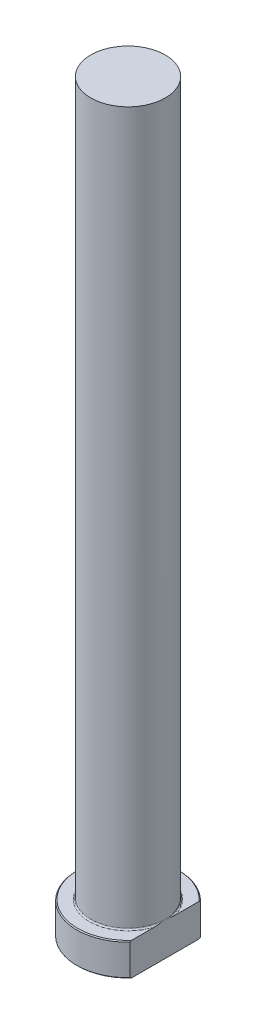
from build123d import *
from build123d.topology import SkipClean

# Parameters (mm, degrees)
CHAMFER1_SIZE = 0.2
FILLET1_R     = 0.3
KEY_DEPTH     = 161.754471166


with BuildPart() as part:
    # Sketch1 → Revolve1 (revolve)
    with BuildSketch(Plane.XY, mode=Mode.PRIVATE) as revolve1_sk:
        Polygon((0, 0), (-11, 0), (-11, 7), (-8, 7), (-8, 160), (0, 160), align=None)
    revolve(revolve1_sk.sketch.rotate(Axis((0, 259.958771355, 0), (0, -1, 0)), 270), axis=Axis((0, 259.958771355, 0), (0, -1, 0)))

    # Chamfer1
    chamfer1_edges = [part.edges().sort_by_distance(p)[0] for p in [
        (0, 7, -11),
        (0, 0, -11),
    ]]
    chamfer(chamfer1_edges, length=CHAMFER1_SIZE)

    # Fillet1
    fillet1_edges = [part.edges().sort_by_distance(p)[0] for p in [
        (0, 7, -8),
    ]]
    fillet(fillet1_edges, radius=FILLET1_R)

    # Sketch2 → KEY (cut, through all)
    with SkipClean():  # the faces are left unmerged after this step: merging them gives an invalid solid
        with BuildSketch(Plane(origin=(0, 0, 0), x_dir=(1, 0, 0), z_dir=(0, 1, 0))):
            with BuildLine():
                Line((8, 7.549834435), (8, -7.549834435))
                ThreePointArc((8, -7.549834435), (11, 0), (8, 7.549834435))
            make_face()
        extrude(amount=KEY_DEPTH, mode=Mode.SUBTRACT)


solid = part.part
